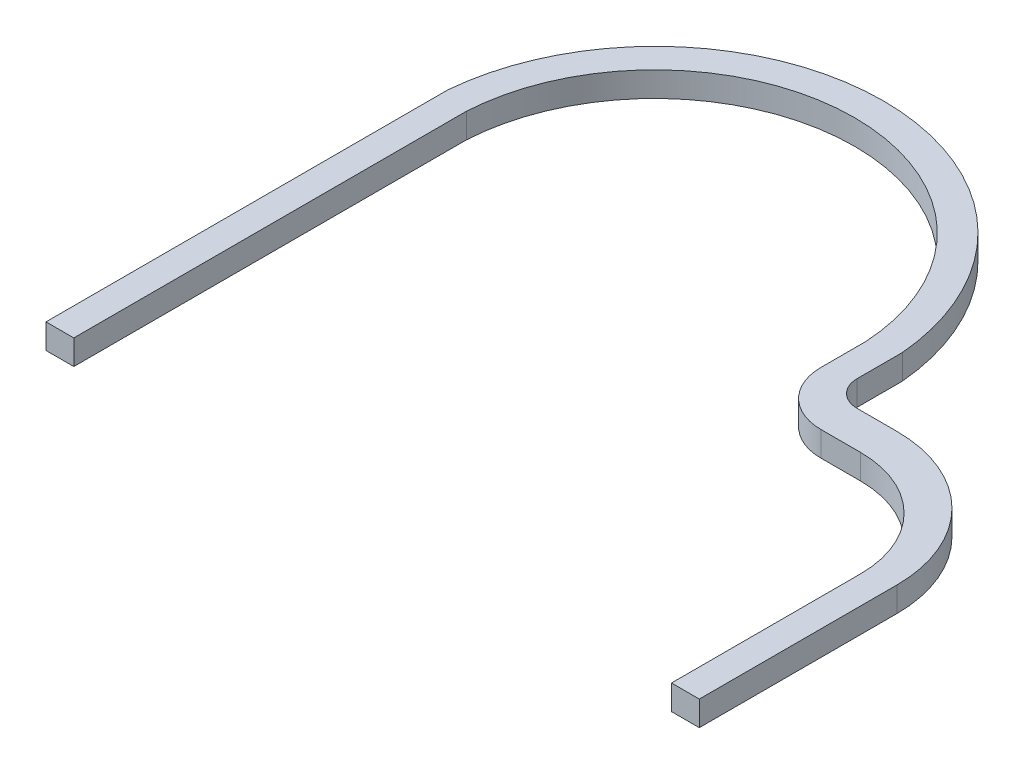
ISO-10303-21;
HEADER;
FILE_DESCRIPTION(('STEP AP214'),'2;1');
FILE_NAME('part.step','',(''),(''),'','','');
FILE_SCHEMA(('AUTOMOTIVE_DESIGN { 1 0 10303 214 1 1 1 1 }'));
ENDSEC;
DATA;
#1=APPLICATION_CONTEXT('core data for automotive mechanical design processes');
#2=APPLICATION_PROTOCOL_DEFINITION('international standard','automotive_design',2000,#1);
#3=PRODUCT_CONTEXT('',#1,'mechanical');
#4=PRODUCT('Part','Part','',(#3));
#5=PRODUCT_RELATED_PRODUCT_CATEGORY('part','',(#4));
#6=PRODUCT_DEFINITION_FORMATION('','',#4);
#7=PRODUCT_DEFINITION_CONTEXT('part definition',#1,'design');
#8=PRODUCT_DEFINITION('design','',#6,#7);
#9=PRODUCT_DEFINITION_SHAPE('','',#8);
#10=(LENGTH_UNIT() NAMED_UNIT(*) SI_UNIT(.MILLI.,.METRE.));
#11=(NAMED_UNIT(*) PLANE_ANGLE_UNIT() SI_UNIT($,.RADIAN.));
#12=(NAMED_UNIT(*) SI_UNIT($,.STERADIAN.) SOLID_ANGLE_UNIT());
#13=UNCERTAINTY_MEASURE_WITH_UNIT(LENGTH_MEASURE(1.E-05),#10,'distance_accuracy_value','');
#14=(GEOMETRIC_REPRESENTATION_CONTEXT(3) GLOBAL_UNCERTAINTY_ASSIGNED_CONTEXT((#13)) GLOBAL_UNIT_ASSIGNED_CONTEXT((#10,
#11,#12)) REPRESENTATION_CONTEXT('',''));
#15=CARTESIAN_POINT('',(0.,0.,0.));
#16=DIRECTION('',(0.,0.,1.));
#17=DIRECTION('',(1.,0.,0.));
#18=AXIS2_PLACEMENT_3D('',#15,#16,#17);
#19=CARTESIAN_POINT('',(0.,3.175,35.433));
#20=DIRECTION('',(0.,0.,-1.));
#21=DIRECTION('',(-1.,0.,0.));
#22=AXIS2_PLACEMENT_3D('',#19,#20,#21);
#23=PLANE('',#22);
#24=DIRECTION('',(1.,0.,0.));
#25=VECTOR('',#24,1.);
#26=CARTESIAN_POINT('',(0.,0.,35.433));
#27=LINE('',#26,#25);
#28=CARTESIAN_POINT('',(-76.708,0.,35.433));
#29=VERTEX_POINT('',#28);
#30=CARTESIAN_POINT('',(-73.152,0.,35.433));
#31=VERTEX_POINT('',#30);
#32=EDGE_CURVE('E182',#29,#31,#27,.T.);
#33=ORIENTED_EDGE('',*,*,#32,.T.);
#34=DIRECTION('',(0.,-1.,0.));
#35=VECTOR('',#34,1.);
#36=CARTESIAN_POINT('',(-73.152,3.175,35.433));
#37=LINE('',#36,#35);
#38=CARTESIAN_POINT('',(-73.152,3.175,35.433));
#39=VERTEX_POINT('',#38);
#40=EDGE_CURVE('E11',#39,#31,#37,.T.);
#41=ORIENTED_EDGE('',*,*,#40,.F.);
#42=DIRECTION('',(1.,0.,0.));
#43=VECTOR('',#42,1.);
#44=CARTESIAN_POINT('',(0.,3.175,35.433));
#45=LINE('',#44,#43);
#46=CARTESIAN_POINT('',(-76.708,3.175,35.433));
#47=VERTEX_POINT('',#46);
#48=EDGE_CURVE('E221',#47,#39,#45,.T.);
#49=ORIENTED_EDGE('',*,*,#48,.F.);
#50=DIRECTION('',(0.,-1.,0.));
#51=VECTOR('',#50,1.);
#52=CARTESIAN_POINT('',(-76.708,3.175,35.433));
#53=LINE('',#52,#51);
#54=EDGE_CURVE('E52',#47,#29,#53,.T.);
#55=ORIENTED_EDGE('',*,*,#54,.T.);
#56=EDGE_LOOP('',(#33,#41,#49,#55));
#57=FACE_BOUND('',#56,.T.);
#58=ADVANCED_FACE('F35',(#57),#23,.F.);
#59=CARTESIAN_POINT('',(-73.152,3.175,0.));
#60=DIRECTION('',(-1.,0.,0.));
#61=DIRECTION('',(0.,0.,1.));
#62=AXIS2_PLACEMENT_3D('',#59,#60,#61);
#63=PLANE('',#62);
#64=DIRECTION('',(0.,0.,-1.));
#65=VECTOR('',#64,1.);
#66=CARTESIAN_POINT('',(-73.152,0.,0.));
#67=LINE('',#66,#65);
#68=CARTESIAN_POINT('',(-73.152,0.,-14.7785047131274));
#69=VERTEX_POINT('',#68);
#70=EDGE_CURVE('E184',#31,#69,#67,.T.);
#71=ORIENTED_EDGE('',*,*,#70,.T.);
#72=DIRECTION('',(0.,-1.,0.));
#73=VECTOR('',#72,1.);
#74=CARTESIAN_POINT('',(-73.152,3.175,-14.7785047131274));
#75=LINE('',#74,#73);
#76=CARTESIAN_POINT('',(-73.152,3.175,-14.7785047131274));
#77=VERTEX_POINT('',#76);
#78=EDGE_CURVE('E44',#77,#69,#75,.T.);
#79=ORIENTED_EDGE('',*,*,#78,.F.);
#80=DIRECTION('',(0.,0.,-1.));
#81=VECTOR('',#80,1.);
#82=CARTESIAN_POINT('',(-73.152,3.175,0.));
#83=LINE('',#82,#81);
#84=EDGE_CURVE('E115',#39,#77,#83,.T.);
#85=ORIENTED_EDGE('',*,*,#84,.F.);
#86=ORIENTED_EDGE('',*,*,#40,.T.);
#87=EDGE_LOOP('',(#71,#79,#85,#86));
#88=FACE_BOUND('',#87,.T.);
#89=ADVANCED_FACE('F37',(#88),#63,.F.);
#90=CARTESIAN_POINT('',(-47.625,3.175,-13.335));
#91=DIRECTION('',(0.,-1.,0.));
#92=DIRECTION('',(0.,0.,-1.));
#93=AXIS2_PLACEMENT_3D('',#90,#91,#92);
#94=CYLINDRICAL_SURFACE('',#93,25.5677811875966);
#95=CARTESIAN_POINT('',(-47.625,0.,-13.335));
#96=DIRECTION('',(0.,1.,0.));
#97=DIRECTION('',(0.,0.,1.));
#98=AXIS2_PLACEMENT_3D('',#95,#96,#97);
#99=CIRCLE('',#98,25.5677811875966);
#100=CARTESIAN_POINT('',(-22.098,0.,-14.7785047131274));
#101=VERTEX_POINT('',#100);
#102=EDGE_CURVE('E188',#101,#69,#99,.T.);
#103=ORIENTED_EDGE('',*,*,#102,.F.);
#104=DIRECTION('',(0.,-1.,0.));
#105=VECTOR('',#104,1.);
#106=CARTESIAN_POINT('',(-22.098,3.175,-14.7785047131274));
#107=LINE('',#106,#105);
#108=CARTESIAN_POINT('',(-22.098,3.175,-14.7785047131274));
#109=VERTEX_POINT('',#108);
#110=EDGE_CURVE('E247',#109,#101,#107,.T.);
#111=ORIENTED_EDGE('',*,*,#110,.F.);
#112=CARTESIAN_POINT('',(-47.625,3.175,-13.335));
#113=DIRECTION('',(0.,1.,0.));
#114=DIRECTION('',(0.,0.,1.));
#115=AXIS2_PLACEMENT_3D('',#112,#113,#114);
#116=CIRCLE('',#115,25.5677811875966);
#117=EDGE_CURVE('E253',#109,#77,#116,.T.);
#118=ORIENTED_EDGE('',*,*,#117,.T.);
#119=ORIENTED_EDGE('',*,*,#78,.T.);
#120=EDGE_LOOP('',(#103,#111,#118,#119));
#121=FACE_BOUND('',#120,.T.);
#122=ADVANCED_FACE('F251',(#121),#94,.F.);
#123=CARTESIAN_POINT('',(-22.098,3.175,0.));
#124=DIRECTION('',(1.,0.,0.));
#125=DIRECTION('',(0.,0.,-1.));
#126=AXIS2_PLACEMENT_3D('',#123,#124,#125);
#127=PLANE('',#126);
#128=DIRECTION('',(0.,0.,1.));
#129=VECTOR('',#128,1.);
#130=CARTESIAN_POINT('',(-22.098,0.,0.));
#131=LINE('',#130,#129);
#132=CARTESIAN_POINT('',(-22.098,0.,-9.06350471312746));
#133=VERTEX_POINT('',#132);
#134=EDGE_CURVE('E191',#101,#133,#131,.T.);
#135=ORIENTED_EDGE('',*,*,#134,.T.);
#136=DIRECTION('',(0.,-1.,0.));
#137=VECTOR('',#136,1.);
#138=CARTESIAN_POINT('',(-22.098,3.175,-9.06350471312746));
#139=LINE('',#138,#137);
#140=CARTESIAN_POINT('',(-22.098,3.175,-9.06350471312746));
#141=VERTEX_POINT('',#140);
#142=EDGE_CURVE('E245',#141,#133,#139,.T.);
#143=ORIENTED_EDGE('',*,*,#142,.F.);
#144=DIRECTION('',(0.,0.,1.));
#145=VECTOR('',#144,1.);
#146=CARTESIAN_POINT('',(-22.098,3.175,0.));
#147=LINE('',#146,#145);
#148=EDGE_CURVE('E264',#109,#141,#147,.T.);
#149=ORIENTED_EDGE('',*,*,#148,.F.);
#150=ORIENTED_EDGE('',*,*,#110,.T.);
#151=EDGE_LOOP('',(#135,#143,#149,#150));
#152=FACE_BOUND('',#151,.T.);
#153=ADVANCED_FACE('F261',(#152),#127,.F.);
#154=CARTESIAN_POINT('',(-15.24,3.175,-9.06350471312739));
#155=DIRECTION('',(0.,-1.,0.));
#156=DIRECTION('',(0.,0.,-1.));
#157=AXIS2_PLACEMENT_3D('',#154,#155,#156);
#158=CYLINDRICAL_SURFACE('',#157,6.858);
#159=CARTESIAN_POINT('',(-15.24,0.,-9.06350471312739));
#160=DIRECTION('',(0.,1.,0.));
#161=DIRECTION('',(0.,0.,1.));
#162=AXIS2_PLACEMENT_3D('',#159,#160,#161);
#163=CIRCLE('',#162,6.858);
#164=CARTESIAN_POINT('',(-15.2399999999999,0.,-2.20550471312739));
#165=VERTEX_POINT('',#164);
#166=EDGE_CURVE('E194',#165,#133,#163,.F.);
#167=ORIENTED_EDGE('',*,*,#166,.F.);
#168=DIRECTION('',(0.,-1.,0.));
#169=VECTOR('',#168,1.);
#170=CARTESIAN_POINT('',(-15.2399999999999,3.175,-2.20550471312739));
#171=LINE('',#170,#169);
#172=CARTESIAN_POINT('',(-15.2399999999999,3.175,-2.20550471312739));
#173=VERTEX_POINT('',#172);
#174=EDGE_CURVE('E243',#173,#165,#171,.T.);
#175=ORIENTED_EDGE('',*,*,#174,.F.);
#176=CARTESIAN_POINT('',(-15.24,3.175,-9.06350471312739));
#177=DIRECTION('',(0.,1.,0.));
#178=DIRECTION('',(0.,0.,1.));
#179=AXIS2_PLACEMENT_3D('',#176,#177,#178);
#180=CIRCLE('',#179,6.858);
#181=EDGE_CURVE('E266',#173,#141,#180,.F.);
#182=ORIENTED_EDGE('',*,*,#181,.T.);
#183=ORIENTED_EDGE('',*,*,#142,.T.);
#184=EDGE_LOOP('',(#167,#175,#182,#183));
#185=FACE_BOUND('',#184,.T.);
#186=ADVANCED_FACE('F427',(#185),#158,.T.);
#187=CARTESIAN_POINT('',(0.,3.175,-2.20550471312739));
#188=DIRECTION('',(0.,0.,1.));
#189=DIRECTION('',(1.,0.,0.));
#190=AXIS2_PLACEMENT_3D('',#187,#188,#189);
#191=PLANE('',#190);
#192=DIRECTION('',(-1.,0.,0.));
#193=VECTOR('',#192,1.);
#194=CARTESIAN_POINT('',(0.,0.,-2.20550471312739));
#195=LINE('',#194,#193);
#196=CARTESIAN_POINT('',(-10.16,0.,-2.20550471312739));
#197=VERTEX_POINT('',#196);
#198=EDGE_CURVE('E197',#197,#165,#195,.T.);
#199=ORIENTED_EDGE('',*,*,#198,.F.);
#200=DIRECTION('',(0.,-1.,0.));
#201=VECTOR('',#200,1.);
#202=CARTESIAN_POINT('',(-10.16,3.175,-2.20550471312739));
#203=LINE('',#202,#201);
#204=CARTESIAN_POINT('',(-10.16,3.175,-2.20550471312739));
#205=VERTEX_POINT('',#204);
#206=EDGE_CURVE('E241',#205,#197,#203,.T.);
#207=ORIENTED_EDGE('',*,*,#206,.F.);
#208=DIRECTION('',(-1.,0.,0.));
#209=VECTOR('',#208,1.);
#210=CARTESIAN_POINT('',(0.,3.175,-2.20550471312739));
#211=LINE('',#210,#209);
#212=EDGE_CURVE('E273',#205,#173,#211,.T.);
#213=ORIENTED_EDGE('',*,*,#212,.T.);
#214=ORIENTED_EDGE('',*,*,#174,.T.);
#215=EDGE_LOOP('',(#199,#207,#213,#214));
#216=FACE_BOUND('',#215,.T.);
#217=ADVANCED_FACE('F418',(#216),#191,.T.);
#218=CARTESIAN_POINT('',(-10.16,3.175,11.2564952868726));
#219=DIRECTION('',(0.,-1.,0.));
#220=DIRECTION('',(0.,0.,-1.));
#221=AXIS2_PLACEMENT_3D('',#218,#219,#220);
#222=CYLINDRICAL_SURFACE('',#221,13.462);
#223=CARTESIAN_POINT('',(-10.16,0.,11.2564952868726));
#224=DIRECTION('',(0.,1.,0.));
#225=DIRECTION('',(0.,0.,1.));
#226=AXIS2_PLACEMENT_3D('',#223,#224,#225);
#227=CIRCLE('',#226,13.462);
#228=CARTESIAN_POINT('',(3.30200000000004,0.,11.2564952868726));
#229=VERTEX_POINT('',#228);
#230=EDGE_CURVE('E200',#229,#197,#227,.T.);
#231=ORIENTED_EDGE('',*,*,#230,.F.);
#232=DIRECTION('',(0.,-1.,0.));
#233=VECTOR('',#232,1.);
#234=CARTESIAN_POINT('',(3.30200000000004,3.175,11.2564952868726));
#235=LINE('',#234,#233);
#236=CARTESIAN_POINT('',(3.30200000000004,3.175,11.2564952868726));
#237=VERTEX_POINT('',#236);
#238=EDGE_CURVE('E239',#237,#229,#235,.T.);
#239=ORIENTED_EDGE('',*,*,#238,.F.);
#240=CARTESIAN_POINT('',(-10.16,3.175,11.2564952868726));
#241=DIRECTION('',(0.,1.,0.));
#242=DIRECTION('',(0.,0.,1.));
#243=AXIS2_PLACEMENT_3D('',#240,#241,#242);
#244=CIRCLE('',#243,13.462);
#245=EDGE_CURVE('E276',#237,#205,#244,.T.);
#246=ORIENTED_EDGE('',*,*,#245,.T.);
#247=ORIENTED_EDGE('',*,*,#206,.T.);
#248=EDGE_LOOP('',(#231,#239,#246,#247));
#249=FACE_BOUND('',#248,.T.);
#250=ADVANCED_FACE('F324',(#249),#222,.F.);
#251=CARTESIAN_POINT('',(3.30200000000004,3.175,0.));
#252=DIRECTION('',(-1.,0.,0.));
#253=DIRECTION('',(0.,0.,1.));
#254=AXIS2_PLACEMENT_3D('',#251,#252,#253);
#255=PLANE('',#254);
#256=DIRECTION('',(0.,0.,-1.));
#257=VECTOR('',#256,1.);
#258=CARTESIAN_POINT('',(3.30200000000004,0.,0.));
#259=LINE('',#258,#257);
#260=CARTESIAN_POINT('',(3.30200000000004,0.,35.433));
#261=VERTEX_POINT('',#260);
#262=EDGE_CURVE('E203',#261,#229,#259,.T.);
#263=ORIENTED_EDGE('',*,*,#262,.F.);
#264=DIRECTION('',(0.,-1.,0.));
#265=VECTOR('',#264,1.);
#266=CARTESIAN_POINT('',(3.30200000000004,3.175,35.433));
#267=LINE('',#266,#265);
#268=CARTESIAN_POINT('',(3.30200000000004,3.175,35.433));
#269=VERTEX_POINT('',#268);
#270=EDGE_CURVE('E237',#269,#261,#267,.T.);
#271=ORIENTED_EDGE('',*,*,#270,.F.);
#272=DIRECTION('',(0.,0.,-1.));
#273=VECTOR('',#272,1.);
#274=CARTESIAN_POINT('',(3.30200000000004,3.175,0.));
#275=LINE('',#274,#273);
#276=EDGE_CURVE('E279',#269,#237,#275,.T.);
#277=ORIENTED_EDGE('',*,*,#276,.T.);
#278=ORIENTED_EDGE('',*,*,#238,.T.);
#279=EDGE_LOOP('',(#263,#271,#277,#278));
#280=FACE_BOUND('',#279,.T.);
#281=ADVANCED_FACE('F316',(#280),#255,.T.);
#282=CARTESIAN_POINT('',(6.858,0.,35.433));
#283=VERTEX_POINT('',#282);
#284=EDGE_CURVE('E185',#261,#283,#27,.T.);
#285=ORIENTED_EDGE('',*,*,#284,.T.);
#286=DIRECTION('',(0.,-1.,0.));
#287=VECTOR('',#286,1.);
#288=CARTESIAN_POINT('',(6.858,3.175,35.433));
#289=LINE('',#288,#287);
#290=CARTESIAN_POINT('',(6.858,3.175,35.433));
#291=VERTEX_POINT('',#290);
#292=EDGE_CURVE('E234',#291,#283,#289,.T.);
#293=ORIENTED_EDGE('',*,*,#292,.F.);
#294=EDGE_CURVE('E282',#269,#291,#45,.T.);
#295=ORIENTED_EDGE('',*,*,#294,.F.);
#296=ORIENTED_EDGE('',*,*,#270,.T.);
#297=EDGE_LOOP('',(#285,#293,#295,#296));
#298=FACE_BOUND('',#297,.T.);
#299=ADVANCED_FACE('F308',(#298),#23,.F.);
#300=CARTESIAN_POINT('',(6.858,3.175,0.));
#301=DIRECTION('',(-1.,0.,0.));
#302=DIRECTION('',(0.,0.,1.));
#303=AXIS2_PLACEMENT_3D('',#300,#301,#302);
#304=PLANE('',#303);
#305=DIRECTION('',(0.,0.,-1.));
#306=VECTOR('',#305,1.);
#307=CARTESIAN_POINT('',(6.858,0.,0.));
#308=LINE('',#307,#306);
#309=CARTESIAN_POINT('',(6.858,0.,10.16));
#310=VERTEX_POINT('',#309);
#311=EDGE_CURVE('E206',#283,#310,#308,.T.);
#312=ORIENTED_EDGE('',*,*,#311,.T.);
#313=DIRECTION('',(0.,-1.,0.));
#314=VECTOR('',#313,1.);
#315=CARTESIAN_POINT('',(6.858,3.175,10.16));
#316=LINE('',#315,#314);
#317=CARTESIAN_POINT('',(6.858,3.175,10.16));
#318=VERTEX_POINT('',#317);
#319=EDGE_CURVE('E231',#318,#310,#316,.T.);
#320=ORIENTED_EDGE('',*,*,#319,.F.);
#321=DIRECTION('',(0.,0.,-1.));
#322=VECTOR('',#321,1.);
#323=CARTESIAN_POINT('',(6.858,3.175,0.));
#324=LINE('',#323,#322);
#325=EDGE_CURVE('E283',#291,#318,#324,.T.);
#326=ORIENTED_EDGE('',*,*,#325,.F.);
#327=ORIENTED_EDGE('',*,*,#292,.T.);
#328=EDGE_LOOP('',(#312,#320,#326,#327));
#329=FACE_BOUND('',#328,.T.);
#330=ADVANCED_FACE('F315',(#329),#304,.F.);
#331=CARTESIAN_POINT('',(-10.16,3.175,10.16));
#332=DIRECTION('',(0.,-1.,0.));
#333=DIRECTION('',(0.,0.,-1.));
#334=AXIS2_PLACEMENT_3D('',#331,#332,#333);
#335=CYLINDRICAL_SURFACE('',#334,17.018);
#336=CARTESIAN_POINT('',(-10.16,0.,10.16));
#337=DIRECTION('',(0.,1.,0.));
#338=DIRECTION('',(0.,0.,1.));
#339=AXIS2_PLACEMENT_3D('',#336,#337,#338);
#340=CIRCLE('',#339,17.018);
#341=CARTESIAN_POINT('',(-10.16,0.,-6.858));
#342=VERTEX_POINT('',#341);
#343=EDGE_CURVE('E208',#310,#342,#340,.T.);
#344=ORIENTED_EDGE('',*,*,#343,.T.);
#345=DIRECTION('',(0.,-1.,0.));
#346=VECTOR('',#345,1.);
#347=CARTESIAN_POINT('',(-10.16,3.175,-6.858));
#348=LINE('',#347,#346);
#349=CARTESIAN_POINT('',(-10.16,3.175,-6.858));
#350=VERTEX_POINT('',#349);
#351=EDGE_CURVE('E228',#350,#342,#348,.T.);
#352=ORIENTED_EDGE('',*,*,#351,.F.);
#353=CARTESIAN_POINT('',(-10.16,3.175,10.16));
#354=DIRECTION('',(0.,1.,0.));
#355=DIRECTION('',(0.,0.,1.));
#356=AXIS2_PLACEMENT_3D('',#353,#354,#355);
#357=CIRCLE('',#356,17.018);
#358=EDGE_CURVE('E285',#318,#350,#357,.T.);
#359=ORIENTED_EDGE('',*,*,#358,.F.);
#360=ORIENTED_EDGE('',*,*,#319,.T.);
#361=EDGE_LOOP('',(#344,#352,#359,#360));
#362=FACE_BOUND('',#361,.T.);
#363=ADVANCED_FACE('F322',(#362),#335,.T.);
#364=CARTESIAN_POINT('',(0.,3.175,-6.858));
#365=DIRECTION('',(0.,0.,1.));
#366=DIRECTION('',(1.,0.,0.));
#367=AXIS2_PLACEMENT_3D('',#364,#365,#366);
#368=PLANE('',#367);
#369=DIRECTION('',(-1.,0.,0.));
#370=VECTOR('',#369,1.);
#371=CARTESIAN_POINT('',(0.,0.,-6.858));
#372=LINE('',#371,#370);
#373=CARTESIAN_POINT('',(-15.24,0.,-6.858));
#374=VERTEX_POINT('',#373);
#375=EDGE_CURVE('E210',#342,#374,#372,.T.);
#376=ORIENTED_EDGE('',*,*,#375,.T.);
#377=DIRECTION('',(0.,-1.,0.));
#378=VECTOR('',#377,1.);
#379=CARTESIAN_POINT('',(-15.24,3.175,-6.858));
#380=LINE('',#379,#378);
#381=CARTESIAN_POINT('',(-15.24,3.175,-6.858));
#382=VERTEX_POINT('',#381);
#383=EDGE_CURVE('E225',#382,#374,#380,.T.);
#384=ORIENTED_EDGE('',*,*,#383,.F.);
#385=DIRECTION('',(-1.,0.,0.));
#386=VECTOR('',#385,1.);
#387=CARTESIAN_POINT('',(0.,3.175,-6.858));
#388=LINE('',#387,#386);
#389=EDGE_CURVE('E177',#350,#382,#388,.T.);
#390=ORIENTED_EDGE('',*,*,#389,.F.);
#391=ORIENTED_EDGE('',*,*,#351,.T.);
#392=EDGE_LOOP('',(#376,#384,#390,#391));
#393=FACE_BOUND('',#392,.T.);
#394=ADVANCED_FACE('F291',(#393),#368,.F.);
#395=CARTESIAN_POINT('',(-15.24,3.175,-10.16));
#396=DIRECTION('',(0.,-1.,0.));
#397=DIRECTION('',(0.,0.,-1.));
#398=AXIS2_PLACEMENT_3D('',#395,#396,#397);
#399=CYLINDRICAL_SURFACE('',#398,3.302);
#400=CARTESIAN_POINT('',(-15.24,0.,-10.16));
#401=DIRECTION('',(0.,1.,0.));
#402=DIRECTION('',(0.,0.,1.));
#403=AXIS2_PLACEMENT_3D('',#400,#401,#402);
#404=CIRCLE('',#403,3.302);
#405=CARTESIAN_POINT('',(-18.542,0.,-10.16));
#406=VERTEX_POINT('',#405);
#407=EDGE_CURVE('E212',#374,#406,#404,.F.);
#408=ORIENTED_EDGE('',*,*,#407,.T.);
#409=DIRECTION('',(0.,-1.,0.));
#410=VECTOR('',#409,1.);
#411=CARTESIAN_POINT('',(-18.542,3.175,-10.16));
#412=LINE('',#411,#410);
#413=CARTESIAN_POINT('',(-18.542,3.175,-10.16));
#414=VERTEX_POINT('',#413);
#415=EDGE_CURVE('E164',#414,#406,#412,.T.);
#416=ORIENTED_EDGE('',*,*,#415,.F.);
#417=CARTESIAN_POINT('',(-15.24,3.175,-10.16));
#418=DIRECTION('',(0.,1.,0.));
#419=DIRECTION('',(0.,0.,1.));
#420=AXIS2_PLACEMENT_3D('',#417,#418,#419);
#421=CIRCLE('',#420,3.302);
#422=EDGE_CURVE('E174',#382,#414,#421,.F.);
#423=ORIENTED_EDGE('',*,*,#422,.F.);
#424=ORIENTED_EDGE('',*,*,#383,.T.);
#425=EDGE_LOOP('',(#408,#416,#423,#424));
#426=FACE_BOUND('',#425,.T.);
#427=ADVANCED_FACE('F295',(#426),#399,.F.);
#428=CARTESIAN_POINT('',(-18.5420000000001,3.175,-2.66482218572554E-13));
#429=DIRECTION('',(1.,0.,0.));
#430=DIRECTION('',(0.,0.,-1.));
#431=AXIS2_PLACEMENT_3D('',#428,#429,#430);
#432=PLANE('',#431);
#433=DIRECTION('',(0.,0.,1.));
#434=VECTOR('',#433,1.);
#435=CARTESIAN_POINT('',(-18.5420000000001,0.,-2.66482218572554E-13));
#436=LINE('',#435,#434);
#437=CARTESIAN_POINT('',(-18.5419999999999,0.,-15.9537511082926));
#438=VERTEX_POINT('',#437);
#439=EDGE_CURVE('E161',#438,#406,#436,.T.);
#440=ORIENTED_EDGE('',*,*,#439,.F.);
#441=DIRECTION('',(0.,-1.,0.));
#442=VECTOR('',#441,1.);
#443=CARTESIAN_POINT('',(-18.5419999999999,3.175,-15.9537511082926));
#444=LINE('',#443,#442);
#445=CARTESIAN_POINT('',(-18.5419999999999,3.175,-15.9537511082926));
#446=VERTEX_POINT('',#445);
#447=EDGE_CURVE('E155',#446,#438,#444,.T.);
#448=ORIENTED_EDGE('',*,*,#447,.F.);
#449=DIRECTION('',(0.,0.,1.));
#450=VECTOR('',#449,1.);
#451=CARTESIAN_POINT('',(-18.5420000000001,3.175,-2.66482218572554E-13));
#452=LINE('',#451,#450);
#453=EDGE_CURVE('E159',#446,#414,#452,.T.);
#454=ORIENTED_EDGE('',*,*,#453,.T.);
#455=ORIENTED_EDGE('',*,*,#415,.T.);
#456=EDGE_LOOP('',(#440,#448,#454,#455));
#457=FACE_BOUND('',#456,.T.);
#458=ADVANCED_FACE('F157',(#457),#432,.T.);
#459=CARTESIAN_POINT('',(-47.625,3.175,-13.4125578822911));
#460=DIRECTION('',(0.,-1.,0.));
#461=DIRECTION('',(0.,0.,-1.));
#462=AXIS2_PLACEMENT_3D('',#459,#460,#461);
#463=CYLINDRICAL_SURFACE('',#462,29.1938101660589);
#464=CARTESIAN_POINT('',(-47.625,0.,-13.4125578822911));
#465=DIRECTION('',(0.,1.,0.));
#466=DIRECTION('',(0.,0.,1.));
#467=AXIS2_PLACEMENT_3D('',#464,#465,#466);
#468=CIRCLE('',#467,29.1938101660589);
#469=CARTESIAN_POINT('',(-76.708,0.,-15.9537511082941));
#470=VERTEX_POINT('',#469);
#471=EDGE_CURVE('E216',#438,#470,#468,.T.);
#472=ORIENTED_EDGE('',*,*,#471,.T.);
#473=DIRECTION('',(0.,-1.,0.));
#474=VECTOR('',#473,1.);
#475=CARTESIAN_POINT('',(-76.708,3.175,-15.9537511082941));
#476=LINE('',#475,#474);
#477=CARTESIAN_POINT('',(-76.708,3.175,-15.9537511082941));
#478=VERTEX_POINT('',#477);
#479=EDGE_CURVE('E103',#478,#470,#476,.T.);
#480=ORIENTED_EDGE('',*,*,#479,.F.);
#481=CARTESIAN_POINT('',(-47.625,3.175,-13.4125578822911));
#482=DIRECTION('',(0.,1.,0.));
#483=DIRECTION('',(0.,0.,1.));
#484=AXIS2_PLACEMENT_3D('',#481,#482,#483);
#485=CIRCLE('',#484,29.1938101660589);
#486=EDGE_CURVE('E166',#446,#478,#485,.T.);
#487=ORIENTED_EDGE('',*,*,#486,.F.);
#488=ORIENTED_EDGE('',*,*,#447,.T.);
#489=EDGE_LOOP('',(#472,#480,#487,#488));
#490=FACE_BOUND('',#489,.T.);
#491=ADVANCED_FACE('F167',(#490),#463,.T.);
#492=CARTESIAN_POINT('',(-76.708,3.175,0.));
#493=DIRECTION('',(-1.,0.,0.));
#494=DIRECTION('',(0.,0.,1.));
#495=AXIS2_PLACEMENT_3D('',#492,#493,#494);
#496=PLANE('',#495);
#497=DIRECTION('',(0.,0.,-1.));
#498=VECTOR('',#497,1.);
#499=CARTESIAN_POINT('',(-76.708,0.,0.));
#500=LINE('',#499,#498);
#501=EDGE_CURVE('E218',#29,#470,#500,.T.);
#502=ORIENTED_EDGE('',*,*,#501,.F.);
#503=ORIENTED_EDGE('',*,*,#54,.F.);
#504=DIRECTION('',(0.,0.,-1.));
#505=VECTOR('',#504,1.);
#506=CARTESIAN_POINT('',(-76.708,3.175,0.));
#507=LINE('',#506,#505);
#508=EDGE_CURVE('E170',#47,#478,#507,.T.);
#509=ORIENTED_EDGE('',*,*,#508,.T.);
#510=ORIENTED_EDGE('',*,*,#479,.T.);
#511=EDGE_LOOP('',(#502,#503,#509,#510));
#512=FACE_BOUND('',#511,.T.);
#513=ADVANCED_FACE('F296',(#512),#496,.T.);
#514=CARTESIAN_POINT('',(0.,3.175,0.));
#515=DIRECTION('',(0.,1.,0.));
#516=DIRECTION('',(0.,0.,1.));
#517=AXIS2_PLACEMENT_3D('',#514,#515,#516);
#518=PLANE('',#517);
#519=ORIENTED_EDGE('',*,*,#48,.T.);
#520=ORIENTED_EDGE('',*,*,#84,.T.);
#521=ORIENTED_EDGE('',*,*,#117,.F.);
#522=ORIENTED_EDGE('',*,*,#148,.T.);
#523=ORIENTED_EDGE('',*,*,#181,.F.);
#524=ORIENTED_EDGE('',*,*,#212,.F.);
#525=ORIENTED_EDGE('',*,*,#245,.F.);
#526=ORIENTED_EDGE('',*,*,#276,.F.);
#527=ORIENTED_EDGE('',*,*,#294,.T.);
#528=ORIENTED_EDGE('',*,*,#325,.T.);
#529=ORIENTED_EDGE('',*,*,#358,.T.);
#530=ORIENTED_EDGE('',*,*,#389,.T.);
#531=ORIENTED_EDGE('',*,*,#422,.T.);
#532=ORIENTED_EDGE('',*,*,#453,.F.);
#533=ORIENTED_EDGE('',*,*,#486,.T.);
#534=ORIENTED_EDGE('',*,*,#508,.F.);
#535=EDGE_LOOP('',(#519,#520,#521,#522,#523,#524,#525,#526,#527,#528,#529,#530,#531,#532,#533,#534));
#536=FACE_BOUND('',#535,.T.);
#537=ADVANCED_FACE('F172',(#536),#518,.T.);
#538=CARTESIAN_POINT('',(0.,0.,0.));
#539=DIRECTION('',(0.,1.,0.));
#540=DIRECTION('',(0.,0.,1.));
#541=AXIS2_PLACEMENT_3D('',#538,#539,#540);
#542=PLANE('',#541);
#543=ORIENTED_EDGE('',*,*,#32,.F.);
#544=ORIENTED_EDGE('',*,*,#501,.T.);
#545=ORIENTED_EDGE('',*,*,#471,.F.);
#546=ORIENTED_EDGE('',*,*,#439,.T.);
#547=ORIENTED_EDGE('',*,*,#407,.F.);
#548=ORIENTED_EDGE('',*,*,#375,.F.);
#549=ORIENTED_EDGE('',*,*,#343,.F.);
#550=ORIENTED_EDGE('',*,*,#311,.F.);
#551=ORIENTED_EDGE('',*,*,#284,.F.);
#552=ORIENTED_EDGE('',*,*,#262,.T.);
#553=ORIENTED_EDGE('',*,*,#230,.T.);
#554=ORIENTED_EDGE('',*,*,#198,.T.);
#555=ORIENTED_EDGE('',*,*,#166,.T.);
#556=ORIENTED_EDGE('',*,*,#134,.F.);
#557=ORIENTED_EDGE('',*,*,#102,.T.);
#558=ORIENTED_EDGE('',*,*,#70,.F.);
#559=EDGE_LOOP('',(#543,#544,#545,#546,#547,#548,#549,#550,#551,#552,#553,#554,#555,#556,#557,#558));
#560=FACE_BOUND('',#559,.T.);
#561=ADVANCED_FACE('F257',(#560),#542,.F.);
#562=CLOSED_SHELL('',(#58,#89,#122,#153,#186,#217,#250,#281,#299,#330,#363,#394,#427,#458,#491,
#513,#537,#561));
#563=MANIFOLD_SOLID_BREP('B2',#562);
#564=ADVANCED_BREP_SHAPE_REPRESENTATION('',(#18,#563),#14);
#565=SHAPE_DEFINITION_REPRESENTATION(#9,#564);
ENDSEC;
END-ISO-10303-21;
